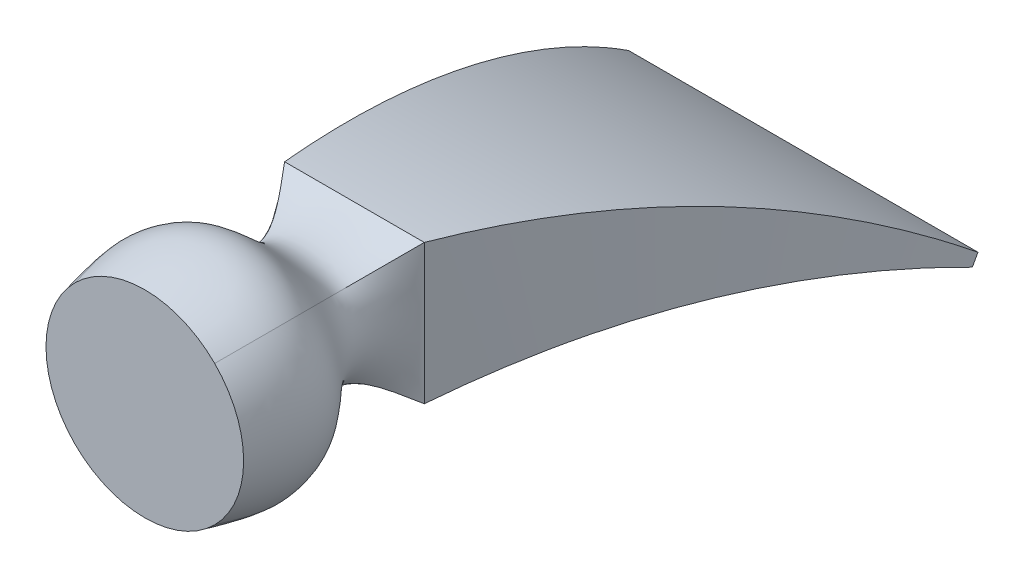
ISO-10303-21;
HEADER;
FILE_DESCRIPTION(('STEP AP214'),'2;1');
FILE_NAME('part.step','',(''),(''),'','','');
FILE_SCHEMA(('AUTOMOTIVE_DESIGN { 1 0 10303 214 1 1 1 1 }'));
ENDSEC;
DATA;
#1=APPLICATION_CONTEXT('core data for automotive mechanical design processes');
#2=APPLICATION_PROTOCOL_DEFINITION('international standard','automotive_design',2000,#1);
#3=PRODUCT_CONTEXT('',#1,'mechanical');
#4=PRODUCT('Part','Part','',(#3));
#5=PRODUCT_RELATED_PRODUCT_CATEGORY('part','',(#4));
#6=PRODUCT_DEFINITION_FORMATION('','',#4);
#7=PRODUCT_DEFINITION_CONTEXT('part definition',#1,'design');
#8=PRODUCT_DEFINITION('design','',#6,#7);
#9=PRODUCT_DEFINITION_SHAPE('','',#8);
#10=(LENGTH_UNIT() NAMED_UNIT(*) SI_UNIT(.MILLI.,.METRE.));
#11=(NAMED_UNIT(*) PLANE_ANGLE_UNIT() SI_UNIT($,.RADIAN.));
#12=(NAMED_UNIT(*) SI_UNIT($,.STERADIAN.) SOLID_ANGLE_UNIT());
#13=UNCERTAINTY_MEASURE_WITH_UNIT(LENGTH_MEASURE(1.E-05),#10,'distance_accuracy_value','');
#14=(GEOMETRIC_REPRESENTATION_CONTEXT(3) GLOBAL_UNCERTAINTY_ASSIGNED_CONTEXT((#13)) GLOBAL_UNIT_ASSIGNED_CONTEXT((#10,
#11,#12)) REPRESENTATION_CONTEXT('',''));
#15=CARTESIAN_POINT('',(0.,0.,0.));
#16=DIRECTION('',(0.,0.,1.));
#17=DIRECTION('',(1.,0.,0.));
#18=AXIS2_PLACEMENT_3D('',#15,#16,#17);
#19=CARTESIAN_POINT('',(0.,0.,90.));
#20=DIRECTION('',(0.,0.,1.));
#21=DIRECTION('',(1.,0.,0.));
#22=AXIS2_PLACEMENT_3D('',#19,#20,#21);
#23=PLANE('',#22);
#24=CARTESIAN_POINT('',(0.,0.,90.));
#25=DIRECTION('',(0.,0.,1.));
#26=DIRECTION('',(1.,0.,0.));
#27=AXIS2_PLACEMENT_3D('',#24,#25,#26);
#28=CIRCLE('',#27,42.4264068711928);
#29=CARTESIAN_POINT('',(30.,-30.,90.));
#30=VERTEX_POINT('',#29);
#31=CARTESIAN_POINT('',(30.,30.,90.));
#32=VERTEX_POINT('',#31);
#33=EDGE_CURVE('E13',#30,#32,#28,.T.);
#34=ORIENTED_EDGE('',*,*,#33,.T.);
#35=CARTESIAN_POINT('',(0.,0.,90.));
#36=DIRECTION('',(0.,0.,1.));
#37=DIRECTION('',(1.,0.,0.));
#38=AXIS2_PLACEMENT_3D('',#35,#36,#37);
#39=CIRCLE('',#38,42.4264068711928);
#40=CARTESIAN_POINT('',(-30.,30.,90.));
#41=VERTEX_POINT('',#40);
#42=EDGE_CURVE('E171',#32,#41,#39,.T.);
#43=ORIENTED_EDGE('',*,*,#42,.T.);
#44=CARTESIAN_POINT('',(0.,0.,90.));
#45=DIRECTION('',(0.,0.,1.));
#46=DIRECTION('',(1.,0.,0.));
#47=AXIS2_PLACEMENT_3D('',#44,#45,#46);
#48=CIRCLE('',#47,42.4264068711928);
#49=CARTESIAN_POINT('',(-30.,-30.,90.));
#50=VERTEX_POINT('',#49);
#51=EDGE_CURVE('E324',#41,#50,#48,.T.);
#52=ORIENTED_EDGE('',*,*,#51,.T.);
#53=CARTESIAN_POINT('',(0.,0.,90.));
#54=DIRECTION('',(0.,0.,1.));
#55=DIRECTION('',(1.,0.,0.));
#56=AXIS2_PLACEMENT_3D('',#53,#54,#55);
#57=CIRCLE('',#56,42.4264068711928);
#58=EDGE_CURVE('E317',#50,#30,#57,.T.);
#59=ORIENTED_EDGE('',*,*,#58,.T.);
#60=EDGE_LOOP('',(#34,#43,#52,#59));
#61=FACE_BOUND('',#60,.T.);
#62=ADVANCED_FACE('F157',(#61),#23,.T.);
#63=CARTESIAN_POINT('',(30.,-30.,90.));
#64=CARTESIAN_POINT('',(32.5042152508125,-32.5042152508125,75.870077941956));
#65=CARTESIAN_POINT('',(36.9162822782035,-36.9162822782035,50.9751879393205));
#66=CARTESIAN_POINT('',(10.49978959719,-10.49978959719,26.5586124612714));
#67=CARTESIAN_POINT('',(23.6871317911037,-23.6871317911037,8.59790826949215));
#68=CARTESIAN_POINT('',(30.,-30.,0.));
#69=CARTESIAN_POINT('',(12.4264068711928,-47.5735931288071,90.));
#70=CARTESIAN_POINT('',(13.3352391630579,-50.6144436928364,74.4669857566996));
#71=CARTESIAN_POINT('',(14.8203809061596,-55.583560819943,49.084164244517));
#72=CARTESIAN_POINT('',(4.36154421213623,-20.5894703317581,30.1541983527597));
#73=CARTESIAN_POINT('',(8.71098951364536,-27.848653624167,6.89356791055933));
#74=CARTESIAN_POINT('',(10.,-30.,0.));
#75=CARTESIAN_POINT('',(-12.4264068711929,-47.5735931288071,90.));
#76=CARTESIAN_POINT('',(-13.3352391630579,-50.6144436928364,74.4669857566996));
#77=CARTESIAN_POINT('',(-14.8203809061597,-55.583560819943,49.084164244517));
#78=CARTESIAN_POINT('',(-4.36154421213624,-20.5894703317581,30.1541983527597));
#79=CARTESIAN_POINT('',(-8.71098951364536,-27.848653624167,6.89356791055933));
#80=CARTESIAN_POINT('',(-9.99999999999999,-30.,0.));
#81=CARTESIAN_POINT('',(-30.,-30.,90.));
#82=CARTESIAN_POINT('',(-32.5042152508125,-32.5042152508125,75.870077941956));
#83=CARTESIAN_POINT('',(-36.9162822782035,-36.9162822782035,50.9751879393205));
#84=CARTESIAN_POINT('',(-10.49978959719,-10.49978959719,26.5586124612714));
#85=CARTESIAN_POINT('',(-23.6871317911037,-23.6871317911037,8.59790826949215));
#86=CARTESIAN_POINT('',(-30.,-30.,0.));
#87=(BOUNDED_SURFACE() B_SPLINE_SURFACE(3,3,((#63,#64,#65,#66,#67,#68),(#69,#70,#71,#72,#73,
#74),(#75,#76,#77,#78,#79,#80),(#81,#82,#83,#84,#85,#86)),.UNSPECIFIED.,.F.,.F.,
.F.) B_SPLINE_SURFACE_WITH_KNOTS((4,4),(4,1,1,4),(0.,1.),(0.,0.406260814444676,
0.715773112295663,1.),
.UNSPECIFIED.) GEOMETRIC_REPRESENTATION_ITEM() RATIONAL_B_SPLINE_SURFACE(((1.,1.,1.,1.,1.,1.),
(0.804737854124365,0.804737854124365,0.843761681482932,0.706169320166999,1.,1.),
(0.804737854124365,0.804737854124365,0.843761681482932,0.706169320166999,1.,1.),(1.,1.,1.,1.,1.,1.))) REPRESENTATION_ITEM('') SURFACE());
#88=CARTESIAN_POINT('',(-30.,-30.,90.));
#89=CARTESIAN_POINT('',(-32.5042152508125,-32.5042152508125,75.870077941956));
#90=CARTESIAN_POINT('',(-36.9162822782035,-36.9162822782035,50.9751879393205));
#91=CARTESIAN_POINT('',(-10.49978959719,-10.49978959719,26.5586124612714));
#92=CARTESIAN_POINT('',(-23.6871317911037,-23.6871317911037,8.59790826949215));
#93=CARTESIAN_POINT('',(-30.,-30.,0.));
#94=B_SPLINE_CURVE_WITH_KNOTS('',3,(#88,#89,#90,#91,#92,#93),.UNSPECIFIED.,.F.,.F.,(4,1,1,4),
(0.,0.406260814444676,0.715773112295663,1.),.UNSPECIFIED.);
#95=CARTESIAN_POINT('',(-30.,-30.,0.));
#96=VERTEX_POINT('',#95);
#97=EDGE_CURVE('E293',#50,#96,#94,.T.);
#98=DIRECTION('',(1.,0.,0.));
#99=VECTOR('',#98,1.);
#100=CARTESIAN_POINT('',(-30.,-30.,0.));
#101=LINE('',#100,#99);
#102=CARTESIAN_POINT('',(30.,-30.,0.));
#103=VERTEX_POINT('',#102);
#104=EDGE_CURVE('E292',#96,#103,#101,.T.);
#105=CARTESIAN_POINT('',(30.,-30.,0.));
#106=CARTESIAN_POINT('',(23.6871317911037,-23.6871317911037,8.59790826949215));
#107=CARTESIAN_POINT('',(10.49978959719,-10.49978959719,26.5586124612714));
#108=CARTESIAN_POINT('',(36.9162822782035,-36.9162822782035,50.9751879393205));
#109=CARTESIAN_POINT('',(32.5042152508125,-32.5042152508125,75.870077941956));
#110=CARTESIAN_POINT('',(30.,-30.,90.));
#111=B_SPLINE_CURVE_WITH_KNOTS('',3,(#105,#106,#107,#108,#109,#110),.UNSPECIFIED.,.F.,.F.,(4,1,
1,4),(0.,0.284226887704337,0.593739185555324,1.),.UNSPECIFIED.);
#112=EDGE_CURVE('E230',#103,#30,#111,.T.);
#113=ORIENTED_EDGE('',*,*,#58,.F.);
#114=ORIENTED_EDGE('',*,*,#97,.T.);
#115=ORIENTED_EDGE('',*,*,#104,.T.);
#116=ORIENTED_EDGE('',*,*,#112,.T.);
#117=EDGE_LOOP('',(#113,#114,#115,#116));
#118=FACE_BOUND('',#117,.T.);
#119=ADVANCED_FACE('F341',(#118),#87,.T.);
#120=CARTESIAN_POINT('',(-30.,-30.,90.));
#121=CARTESIAN_POINT('',(-32.5042152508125,-32.5042152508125,75.870077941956));
#122=CARTESIAN_POINT('',(-36.9162822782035,-36.9162822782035,50.9751879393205));
#123=CARTESIAN_POINT('',(-10.49978959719,-10.49978959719,26.5586124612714));
#124=CARTESIAN_POINT('',(-23.6871317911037,-23.6871317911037,8.59790826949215));
#125=CARTESIAN_POINT('',(-30.,-30.,0.));
#126=CARTESIAN_POINT('',(-47.5735931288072,-12.4264068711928,90.));
#127=CARTESIAN_POINT('',(-50.6144436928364,-13.3352391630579,74.4669857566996));
#128=CARTESIAN_POINT('',(-55.583560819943,-14.8203809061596,49.084164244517));
#129=CARTESIAN_POINT('',(-20.5894703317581,-4.36154421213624,30.1541983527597));
#130=CARTESIAN_POINT('',(-27.848653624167,-8.71098951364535,6.89356791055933));
#131=CARTESIAN_POINT('',(-30.,-9.99999999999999,0.));
#132=CARTESIAN_POINT('',(-47.5735931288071,12.4264068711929,90.));
#133=CARTESIAN_POINT('',(-50.6144436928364,13.3352391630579,74.4669857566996));
#134=CARTESIAN_POINT('',(-55.583560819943,14.8203809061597,49.084164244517));
#135=CARTESIAN_POINT('',(-20.5894703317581,4.36154421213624,30.1541983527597));
#136=CARTESIAN_POINT('',(-27.848653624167,8.71098951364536,6.89356791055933));
#137=CARTESIAN_POINT('',(-30.,10.,0.));
#138=CARTESIAN_POINT('',(-30.,30.,90.));
#139=CARTESIAN_POINT('',(-32.5042152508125,32.5042152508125,75.870077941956));
#140=CARTESIAN_POINT('',(-36.9162822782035,36.9162822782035,50.9751879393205));
#141=CARTESIAN_POINT('',(-10.49978959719,10.49978959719,26.5586124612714));
#142=CARTESIAN_POINT('',(-23.6871317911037,23.6871317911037,8.59790826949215));
#143=CARTESIAN_POINT('',(-30.,30.,0.));
#144=(BOUNDED_SURFACE() B_SPLINE_SURFACE(3,3,((#120,#121,#122,#123,#124,#125),(#126,#127,#128,
#129,#130,#131),(#132,#133,#134,#135,#136,#137),(#138,#139,#140,#141,#142,#143)),.UNSPECIFIED.,
.F.,.F.,.F.) B_SPLINE_SURFACE_WITH_KNOTS((4,4),(4,1,1,4),(0.,1.),(0.,0.406260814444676,
0.715773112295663,1.),
.UNSPECIFIED.) GEOMETRIC_REPRESENTATION_ITEM() RATIONAL_B_SPLINE_SURFACE(((1.,1.,1.,1.,1.,1.),
(0.804737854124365,0.804737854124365,0.843761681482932,0.706169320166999,1.,1.),
(0.804737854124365,0.804737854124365,0.843761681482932,0.706169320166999,1.,1.),(1.,1.,1.,1.,1.,1.))) REPRESENTATION_ITEM('') SURFACE());
#145=CARTESIAN_POINT('',(-30.,30.,90.));
#146=CARTESIAN_POINT('',(-32.5042152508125,32.5042152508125,75.870077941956));
#147=CARTESIAN_POINT('',(-36.9162822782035,36.9162822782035,50.9751879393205));
#148=CARTESIAN_POINT('',(-10.49978959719,10.49978959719,26.5586124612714));
#149=CARTESIAN_POINT('',(-23.6871317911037,23.6871317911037,8.59790826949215));
#150=CARTESIAN_POINT('',(-30.,30.,0.));
#151=B_SPLINE_CURVE_WITH_KNOTS('',3,(#145,#146,#147,#148,#149,#150),.UNSPECIFIED.,.F.,.F.,(4,1,
1,4),(0.,0.406260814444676,0.715773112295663,1.),.UNSPECIFIED.);
#152=CARTESIAN_POINT('',(-30.,30.,0.));
#153=VERTEX_POINT('',#152);
#154=EDGE_CURVE('E291',#41,#153,#151,.T.);
#155=DIRECTION('',(0.,-1.,0.));
#156=VECTOR('',#155,1.);
#157=CARTESIAN_POINT('',(-30.,30.,0.));
#158=LINE('',#157,#156);
#159=EDGE_CURVE('E233',#153,#96,#158,.T.);
#160=ORIENTED_EDGE('',*,*,#51,.F.);
#161=ORIENTED_EDGE('',*,*,#154,.T.);
#162=ORIENTED_EDGE('',*,*,#159,.T.);
#163=ORIENTED_EDGE('',*,*,#97,.F.);
#164=EDGE_LOOP('',(#160,#161,#162,#163));
#165=FACE_BOUND('',#164,.T.);
#166=ADVANCED_FACE('F336',(#165),#144,.T.);
#167=CARTESIAN_POINT('',(30.,30.,90.));
#168=CARTESIAN_POINT('',(32.5042152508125,32.5042152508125,75.870077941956));
#169=CARTESIAN_POINT('',(36.9162822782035,36.9162822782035,50.9751879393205));
#170=CARTESIAN_POINT('',(10.49978959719,10.49978959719,26.5586124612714));
#171=CARTESIAN_POINT('',(23.6871317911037,23.6871317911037,8.59790826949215));
#172=CARTESIAN_POINT('',(30.,30.,0.));
#173=CARTESIAN_POINT('',(47.5735931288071,12.4264068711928,90.));
#174=CARTESIAN_POINT('',(50.6144436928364,13.3352391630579,74.4669857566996));
#175=CARTESIAN_POINT('',(55.583560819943,14.8203809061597,49.084164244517));
#176=CARTESIAN_POINT('',(20.5894703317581,4.36154421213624,30.1541983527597));
#177=CARTESIAN_POINT('',(27.848653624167,8.71098951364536,6.89356791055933));
#178=CARTESIAN_POINT('',(30.,10.,0.));
#179=CARTESIAN_POINT('',(47.5735931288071,-12.4264068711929,90.));
#180=CARTESIAN_POINT('',(50.6144436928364,-13.3352391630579,74.4669857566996));
#181=CARTESIAN_POINT('',(55.583560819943,-14.8203809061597,49.084164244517));
#182=CARTESIAN_POINT('',(20.5894703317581,-4.36154421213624,30.1541983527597));
#183=CARTESIAN_POINT('',(27.848653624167,-8.71098951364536,6.89356791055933));
#184=CARTESIAN_POINT('',(30.,-10.,0.));
#185=CARTESIAN_POINT('',(30.,-30.,90.));
#186=CARTESIAN_POINT('',(32.5042152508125,-32.5042152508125,75.870077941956));
#187=CARTESIAN_POINT('',(36.9162822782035,-36.9162822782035,50.9751879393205));
#188=CARTESIAN_POINT('',(10.49978959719,-10.49978959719,26.5586124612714));
#189=CARTESIAN_POINT('',(23.6871317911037,-23.6871317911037,8.59790826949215));
#190=CARTESIAN_POINT('',(30.,-30.,0.));
#191=(BOUNDED_SURFACE() B_SPLINE_SURFACE(3,3,((#167,#168,#169,#170,#171,#172),(#173,#174,#175,
#176,#177,#178),(#179,#180,#181,#182,#183,#184),(#185,#186,#187,#188,#189,#190)),.UNSPECIFIED.,
.F.,.F.,.F.) B_SPLINE_SURFACE_WITH_KNOTS((4,4),(4,1,1,4),(0.,1.),(0.,0.406260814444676,
0.715773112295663,1.),
.UNSPECIFIED.) GEOMETRIC_REPRESENTATION_ITEM() RATIONAL_B_SPLINE_SURFACE(((1.,1.,1.,1.,1.,1.),
(0.804737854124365,0.804737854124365,0.843761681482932,0.706169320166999,1.,1.),
(0.804737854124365,0.804737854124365,0.843761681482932,0.706169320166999,1.,1.),(1.,1.,1.,1.,1.,1.))) REPRESENTATION_ITEM('') SURFACE());
#192=DIRECTION('',(0.,1.,0.));
#193=VECTOR('',#192,1.);
#194=CARTESIAN_POINT('',(30.,30.,0.));
#195=LINE('',#194,#193);
#196=CARTESIAN_POINT('',(30.,30.,0.));
#197=VERTEX_POINT('',#196);
#198=EDGE_CURVE('E225',#103,#197,#195,.T.);
#199=CARTESIAN_POINT('',(30.,30.,0.));
#200=CARTESIAN_POINT('',(23.6871317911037,23.6871317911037,8.59790826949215));
#201=CARTESIAN_POINT('',(10.49978959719,10.49978959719,26.5586124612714));
#202=CARTESIAN_POINT('',(36.9162822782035,36.9162822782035,50.9751879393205));
#203=CARTESIAN_POINT('',(32.5042152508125,32.5042152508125,75.870077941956));
#204=CARTESIAN_POINT('',(30.,30.,90.));
#205=B_SPLINE_CURVE_WITH_KNOTS('',3,(#199,#200,#201,#202,#203,#204),.UNSPECIFIED.,.F.,.F.,(4,1,
1,4),(0.,0.284226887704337,0.593739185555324,1.),.UNSPECIFIED.);
#206=EDGE_CURVE('E217',#197,#32,#205,.T.);
#207=ORIENTED_EDGE('',*,*,#33,.F.);
#208=ORIENTED_EDGE('',*,*,#112,.F.);
#209=ORIENTED_EDGE('',*,*,#198,.T.);
#210=ORIENTED_EDGE('',*,*,#206,.T.);
#211=EDGE_LOOP('',(#207,#208,#209,#210));
#212=FACE_BOUND('',#211,.T.);
#213=ADVANCED_FACE('F228',(#212),#191,.T.);
#214=CARTESIAN_POINT('',(-30.,30.,90.));
#215=CARTESIAN_POINT('',(-32.5042152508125,32.5042152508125,75.870077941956));
#216=CARTESIAN_POINT('',(-36.9162822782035,36.9162822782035,50.9751879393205));
#217=CARTESIAN_POINT('',(-10.49978959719,10.49978959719,26.5586124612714));
#218=CARTESIAN_POINT('',(-23.6871317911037,23.6871317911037,8.59790826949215));
#219=CARTESIAN_POINT('',(-30.,30.,0.));
#220=CARTESIAN_POINT('',(-12.4264068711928,47.5735931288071,90.));
#221=CARTESIAN_POINT('',(-13.3352391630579,50.6144436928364,74.4669857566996));
#222=CARTESIAN_POINT('',(-14.8203809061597,55.583560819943,49.084164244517));
#223=CARTESIAN_POINT('',(-4.36154421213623,20.5894703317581,30.1541983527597));
#224=CARTESIAN_POINT('',(-8.71098951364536,27.848653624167,6.89356791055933));
#225=CARTESIAN_POINT('',(-10.,30.,0.));
#226=CARTESIAN_POINT('',(12.4264068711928,47.5735931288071,90.));
#227=CARTESIAN_POINT('',(13.3352391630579,50.6144436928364,74.4669857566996));
#228=CARTESIAN_POINT('',(14.8203809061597,55.583560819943,49.084164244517));
#229=CARTESIAN_POINT('',(4.36154421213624,20.5894703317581,30.1541983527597));
#230=CARTESIAN_POINT('',(8.71098951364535,27.848653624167,6.89356791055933));
#231=CARTESIAN_POINT('',(9.99999999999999,30.,0.));
#232=CARTESIAN_POINT('',(30.,30.,90.));
#233=CARTESIAN_POINT('',(32.5042152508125,32.5042152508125,75.870077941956));
#234=CARTESIAN_POINT('',(36.9162822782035,36.9162822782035,50.9751879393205));
#235=CARTESIAN_POINT('',(10.49978959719,10.49978959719,26.5586124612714));
#236=CARTESIAN_POINT('',(23.6871317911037,23.6871317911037,8.59790826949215));
#237=CARTESIAN_POINT('',(30.,30.,0.));
#238=(BOUNDED_SURFACE() B_SPLINE_SURFACE(3,3,((#214,#215,#216,#217,#218,#219),(#220,#221,#222,
#223,#224,#225),(#226,#227,#228,#229,#230,#231),(#232,#233,#234,#235,#236,#237)),.UNSPECIFIED.,
.F.,.F.,.F.) B_SPLINE_SURFACE_WITH_KNOTS((4,4),(4,1,1,4),(0.,1.),(0.,0.406260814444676,
0.715773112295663,1.),
.UNSPECIFIED.) GEOMETRIC_REPRESENTATION_ITEM() RATIONAL_B_SPLINE_SURFACE(((1.,1.,1.,1.,1.,1.),
(0.804737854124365,0.804737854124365,0.843761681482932,0.706169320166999,1.,1.),
(0.804737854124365,0.804737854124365,0.843761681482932,0.706169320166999,1.,1.),(1.,1.,1.,1.,1.,1.))) REPRESENTATION_ITEM('') SURFACE());
#239=DIRECTION('',(-1.,0.,0.));
#240=VECTOR('',#239,1.);
#241=CARTESIAN_POINT('',(-30.,30.,0.));
#242=LINE('',#241,#240);
#243=EDGE_CURVE('E210',#197,#153,#242,.T.);
#244=ORIENTED_EDGE('',*,*,#42,.F.);
#245=ORIENTED_EDGE('',*,*,#206,.F.);
#246=ORIENTED_EDGE('',*,*,#243,.T.);
#247=ORIENTED_EDGE('',*,*,#154,.F.);
#248=EDGE_LOOP('',(#244,#245,#246,#247));
#249=FACE_BOUND('',#248,.T.);
#250=ADVANCED_FACE('F222',(#249),#238,.T.);
#251=CARTESIAN_POINT('',(75.,-51.8749227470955,-190.302098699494));
#252=DIRECTION('',(0.,-0.486182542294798,-0.873857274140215));
#253=DIRECTION('',(-1.,0.,0.));
#254=AXIS2_PLACEMENT_3D('',#251,#252,#253);
#255=PLANE('',#254);
#256=DIRECTION('',(0.,0.87385727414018,-0.48618254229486));
#257=VECTOR('',#256,1.);
#258=CARTESIAN_POINT('',(75.,-49.690279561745,-191.517555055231));
#259=LINE('',#258,#257);
#260=CARTESIAN_POINT('',(75.,-51.8749227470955,-190.302098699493));
#261=VERTEX_POINT('',#260);
#262=CARTESIAN_POINT('',(75.,-47.5056363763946,-192.733011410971));
#263=VERTEX_POINT('',#262);
#264=EDGE_CURVE('E237',#261,#263,#259,.T.);
#265=ORIENTED_EDGE('',*,*,#264,.F.);
#266=DIRECTION('',(1.,0.,0.));
#267=VECTOR('',#266,1.);
#268=CARTESIAN_POINT('',(-4.00374178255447E-12,-51.8749227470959,-190.302098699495));
#269=LINE('',#268,#267);
#270=CARTESIAN_POINT('',(-74.9999999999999,-51.8749227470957,-190.302098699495));
#271=VERTEX_POINT('',#270);
#272=EDGE_CURVE('E253',#271,#261,#269,.T.);
#273=ORIENTED_EDGE('',*,*,#272,.F.);
#274=DIRECTION('',(0.,-0.87385727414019,0.486182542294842));
#275=VECTOR('',#274,1.);
#276=CARTESIAN_POINT('',(-75.,-49.690279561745,-191.517555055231));
#277=LINE('',#276,#275);
#278=CARTESIAN_POINT('',(-74.9999999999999,-47.5056363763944,-192.733011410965));
#279=VERTEX_POINT('',#278);
#280=EDGE_CURVE('E238',#279,#271,#277,.T.);
#281=ORIENTED_EDGE('',*,*,#280,.F.);
#282=DIRECTION('',(-1.,0.,0.));
#283=VECTOR('',#282,1.);
#284=CARTESIAN_POINT('',(-2.94556046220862E-12,-47.5056363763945,-192.733011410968));
#285=LINE('',#284,#283);
#286=EDGE_CURVE('E239',#263,#279,#285,.T.);
#287=ORIENTED_EDGE('',*,*,#286,.F.);
#288=EDGE_LOOP('',(#265,#273,#281,#287));
#289=FACE_BOUND('',#288,.T.);
#290=ADVANCED_FACE('F159',(#289),#255,.T.);
#291=CARTESIAN_POINT('',(-75.9,-30.,0.));
#292=CARTESIAN_POINT('',(-25.2999999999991,-30.,0.));
#293=CARTESIAN_POINT('',(25.299999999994,-29.9999999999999,0.));
#294=CARTESIAN_POINT('',(75.9000000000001,-30.,0.));
#295=CARTESIAN_POINT('',(-75.9000000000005,-25.8587039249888,-27.8247429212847));
#296=CARTESIAN_POINT('',(-25.299999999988,-25.8587039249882,-27.8247429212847));
#297=CARTESIAN_POINT('',(25.2999999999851,-25.8587039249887,-27.8247429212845));
#298=CARTESIAN_POINT('',(75.9000000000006,-25.8587039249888,-27.8247429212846));
#299=CARTESIAN_POINT('',(-75.8999999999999,-24.4043835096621,-75.5040965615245));
#300=CARTESIAN_POINT('',(-25.2999999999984,-24.404383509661,-75.5040965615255));
#301=CARTESIAN_POINT('',(25.2999999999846,-24.4043835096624,-75.5040965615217));
#302=CARTESIAN_POINT('',(75.9000000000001,-24.404383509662,-75.5040965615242));
#303=CARTESIAN_POINT('',(-75.9,-34.7352218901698,-139.435443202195));
#304=CARTESIAN_POINT('',(-25.3000000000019,-34.7352218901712,-139.435443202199));
#305=CARTESIAN_POINT('',(25.2999999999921,-34.7352218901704,-139.4354432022));
#306=CARTESIAN_POINT('',(75.9000000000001,-34.7352218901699,-139.435443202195));
#307=CARTESIAN_POINT('',(-75.8999999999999,-45.6587187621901,-174.28533023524));
#308=CARTESIAN_POINT('',(-25.2999999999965,-45.6587187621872,-174.285330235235));
#309=CARTESIAN_POINT('',(25.2999999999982,-45.6587187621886,-174.285330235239));
#310=CARTESIAN_POINT('',(75.9,-45.6587187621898,-174.28533023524));
#311=CARTESIAN_POINT('',(-75.9,-51.8749227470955,-190.302098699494));
#312=CARTESIAN_POINT('',(-25.2999999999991,-51.8749227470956,-190.302098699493));
#313=CARTESIAN_POINT('',(25.299999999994,-51.8749227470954,-190.302098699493));
#314=CARTESIAN_POINT('',(75.9000000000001,-51.8749227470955,-190.302098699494));
#315=B_SPLINE_SURFACE_WITH_KNOTS('',3,3,((#291,#292,#293,#294),(#295,#296,#297,#298),(#299,#300,
#301,#302),(#303,#304,#305,#306),(#307,#308,#309,#310),(#311,#312,#313,#314)),.UNSPECIFIED.,.F.,
.F.,.F.,(4,1,1,4),(4,4),(0.,0.435669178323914,0.733921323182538,1.),(0.,1.),.UNSPECIFIED.);
#316=CARTESIAN_POINT('',(-30.,-30.,0.));
#317=CARTESIAN_POINT('',(-30.798412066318,-29.5120778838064,-3.27825663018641));
#318=CARTESIAN_POINT('',(-31.5953504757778,-29.0695945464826,-6.5636176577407));
#319=CARTESIAN_POINT('',(-33.1862582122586,-28.2752958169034,-13.1458186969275));
#320=CARTESIAN_POINT('',(-33.9802276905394,-27.9234757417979,-16.4426581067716));
#321=CARTESIAN_POINT('',(-35.5652442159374,-27.310249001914,-23.0453667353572));
#322=CARTESIAN_POINT('',(-36.3562913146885,-27.0488407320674,-26.3512357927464));
#323=CARTESIAN_POINT('',(-37.9353203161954,-26.6162285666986,-32.9687858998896));
#324=CARTESIAN_POINT('',(-38.7233028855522,-26.4450038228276,-36.2804654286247));
#325=CARTESIAN_POINT('',(-40.2964301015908,-26.1924079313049,-42.9079815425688));
#326=CARTESIAN_POINT('',(-41.0815746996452,-26.1110383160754,-46.2238181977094));
#327=CARTESIAN_POINT('',(-42.6490580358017,-26.037894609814,-52.8572039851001));
#328=CARTESIAN_POINT('',(-43.4313967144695,-26.0461224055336,-56.1747531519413));
#329=CARTESIAN_POINT('',(-45.0742822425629,-26.1574082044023,-63.1531175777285));
#330=CARTESIAN_POINT('',(-45.9345259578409,-26.2702119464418,-66.8138524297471));
#331=CARTESIAN_POINT('',(-47.6516731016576,-26.6042975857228,-74.1311967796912));
#332=CARTESIAN_POINT('',(-48.5085764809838,-26.8255810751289,-77.7878062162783));
#333=CARTESIAN_POINT('',(-50.2190815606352,-27.3763479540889,-85.093651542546));
#334=CARTESIAN_POINT('',(-51.0726832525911,-27.7058316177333,-88.7428874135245));
#335=CARTESIAN_POINT('',(-52.7767986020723,-28.4723107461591,-96.031629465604));
#336=CARTESIAN_POINT('',(-53.6273115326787,-28.9093300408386,-99.6711333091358));
#337=CARTESIAN_POINT('',(-55.3250878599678,-29.8899083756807,-106.936510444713));
#338=CARTESIAN_POINT('',(-56.1723512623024,-30.4334672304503,-110.562383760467));
#339=CARTESIAN_POINT('',(-57.8636656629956,-31.6262322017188,-117.797461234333));
#340=CARTESIAN_POINT('',(-58.707716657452,-32.275438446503,-121.406665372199));
#341=CARTESIAN_POINT('',(-60.4184739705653,-33.7000965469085,-128.715756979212));
#342=CARTESIAN_POINT('',(-61.2850815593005,-34.4788085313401,-132.415032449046));
#343=CARTESIAN_POINT('',(-63.0149752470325,-36.1465620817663,-139.789437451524));
#344=CARTESIAN_POINT('',(-63.8782613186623,-37.0356045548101,-143.464566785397));
#345=CARTESIAN_POINT('',(-65.6015514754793,-38.9228370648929,-150.787514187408));
#346=CARTESIAN_POINT('',(-66.4615555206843,-39.9210284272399,-154.435331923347));
#347=CARTESIAN_POINT('',(-68.1781192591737,-42.0249193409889,-161.699757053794));
#348=CARTESIAN_POINT('',(-69.0346796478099,-43.1305959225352,-165.316370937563));
#349=CARTESIAN_POINT('',(-70.7445686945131,-45.4482740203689,-172.516091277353));
#350=CARTESIAN_POINT('',(-71.5978973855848,-46.6602744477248,-176.099198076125));
#351=CARTESIAN_POINT('',(-73.3013417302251,-49.189220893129,-183.228815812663));
#352=CARTESIAN_POINT('',(-74.1514574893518,-50.5061634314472,-186.775327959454));
#353=CARTESIAN_POINT('',(-74.9999999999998,-51.8749227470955,-190.302098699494));
#354=B_SPLINE_CURVE_WITH_KNOTS('',3,(#316,#317,#318,#319,#320,#321,#322,#323,#324,#325,#326,
#327,#328,#329,#330,#331,#332,#333,#334,#335,#336,#337,#338,#339,#340,#341,#342,#343,#344,#345,
#346,#347,#348,#349,#350,#351,#352,#353),.UNSPECIFIED.,.F.,.F.,(4,2,2,2,2,2,2,2,2,2,2,2,2,2,2,2,
2,2,4),(0.,10.2271999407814,20.4538715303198,30.6803615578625,40.904486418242,51.128785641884,
61.3533001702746,72.6381325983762,83.9231306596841,95.2081573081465,106.495686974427,
117.783196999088,129.070720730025,140.704282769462,152.337940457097,163.971739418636,
175.603057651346,187.234256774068,198.865070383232),.UNSPECIFIED.);
#355=EDGE_CURVE('E218',#96,#271,#354,.T.);
#356=CARTESIAN_POINT('',(30.,-29.9999999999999,0.));
#357=CARTESIAN_POINT('',(30.7984113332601,-29.5120778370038,-3.27825673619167));
#358=CARTESIAN_POINT('',(31.5953455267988,-29.0695943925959,-6.56361870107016));
#359=CARTESIAN_POINT('',(33.1862440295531,-28.2752954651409,-13.1458218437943));
#360=CARTESIAN_POINT('',(33.9802084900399,-27.9234753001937,-16.4426624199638));
#361=CARTESIAN_POINT('',(35.5652203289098,-27.310248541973,-23.0453721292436));
#362=CARTESIAN_POINT('',(36.3562677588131,-27.0488403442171,-26.3512411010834));
#363=CARTESIAN_POINT('',(37.9353039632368,-26.6162283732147,-32.9687894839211));
#364=CARTESIAN_POINT('',(38.7232934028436,-26.4450037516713,-36.2804673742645));
#365=CARTESIAN_POINT('',(40.296438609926,-26.1924080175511,-42.9079792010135));
#366=CARTESIAN_POINT('',(41.0815943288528,-26.111038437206,-46.223813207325));
#367=CARTESIAN_POINT('',(42.6490981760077,-26.0378946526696,-52.8571941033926));
#368=CARTESIAN_POINT('',(43.4314462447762,-26.0461223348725,-56.1747410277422));
#369=CARTESIAN_POINT('',(45.0743458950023,-26.1574078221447,-63.1531020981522));
#370=CARTESIAN_POINT('',(45.9345937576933,-26.2702113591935,-66.8138359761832));
#371=CARTESIAN_POINT('',(47.6517425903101,-26.6042966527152,-74.1311799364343));
#372=CARTESIAN_POINT('',(48.5086435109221,-26.8255800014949,-77.7877899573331));
#373=CARTESIAN_POINT('',(50.2191419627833,-27.3763466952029,-85.0936368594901));
#374=CARTESIAN_POINT('',(51.0727394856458,-27.7058303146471,-88.7428737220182));
#375=CARTESIAN_POINT('',(52.7768526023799,-28.4723092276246,-96.0316163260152));
#376=CARTESIAN_POINT('',(53.6273674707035,-28.9093283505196,-99.6711197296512));
#377=CARTESIAN_POINT('',(55.325149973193,-29.8899062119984,-106.936495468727));
#378=CARTESIAN_POINT('',(56.172417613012,-30.4334647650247,-110.562367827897));
#379=CARTESIAN_POINT('',(57.8637354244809,-31.6262292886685,-117.797444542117));
#380=CARTESIAN_POINT('',(58.7077855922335,-32.2754353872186,-121.406648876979));
#381=CARTESIAN_POINT('',(60.4185343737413,-33.7000935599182,-128.715742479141));
#382=CARTESIAN_POINT('',(61.2851340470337,-34.4788057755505,-132.415019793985));
#383=CARTESIAN_POINT('',(63.0150072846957,-36.1465601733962,-139.789429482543));
#384=CARTESIAN_POINT('',(63.8782808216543,-37.035603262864,-143.464561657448));
#385=CARTESIAN_POINT('',(65.6015491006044,-38.9228369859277,-150.787513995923));
#386=CARTESIAN_POINT('',(66.4615438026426,-39.9210289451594,-154.435333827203));
#387=CARTESIAN_POINT('',(68.1780965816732,-42.0249206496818,-161.699761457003));
#388=CARTESIAN_POINT('',(69.0346553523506,-43.1305974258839,-165.316375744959));
#389=CARTESIAN_POINT('',(70.7445479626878,-45.4482754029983,-172.516095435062));
#390=CARTESIAN_POINT('',(71.5978818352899,-46.6602755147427,-176.099201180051));
#391=CARTESIAN_POINT('',(73.3013360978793,-49.1892213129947,-183.228816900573));
#392=CARTESIAN_POINT('',(74.1514565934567,-50.5061635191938,-186.775328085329));
#393=CARTESIAN_POINT('',(75.,-51.8749227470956,-190.302098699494));
#394=B_SPLINE_CURVE_WITH_KNOTS('',3,(#356,#357,#358,#359,#360,#361,#362,#363,#364,#365,#366,
#367,#368,#369,#370,#371,#372,#373,#374,#375,#376,#377,#378,#379,#380,#381,#382,#383,#384,#385,
#386,#387,#388,#389,#390,#391,#392,#393),.UNSPECIFIED.,.F.,.F.,(4,2,2,2,2,2,2,2,2,2,2,2,2,2,2,2,
2,2,4),(0.,10.2271997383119,20.4538712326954,30.6803612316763,40.9044860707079,51.1287852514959,
61.3532996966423,72.6381321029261,83.9231301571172,95.2081568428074,106.4956864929,
117.783196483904,129.07072014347,140.704282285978,152.337940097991,163.971739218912,
175.603057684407,187.23425701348,198.865070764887),.UNSPECIFIED.);
#395=EDGE_CURVE('E254',#103,#261,#394,.T.);
#396=ORIENTED_EDGE('',*,*,#355,.T.);
#397=ORIENTED_EDGE('',*,*,#272,.T.);
#398=ORIENTED_EDGE('',*,*,#395,.F.);
#399=ORIENTED_EDGE('',*,*,#104,.F.);
#400=EDGE_LOOP('',(#396,#397,#398,#399));
#401=FACE_BOUND('',#400,.T.);
#402=ADVANCED_FACE('F258',(#401),#315,.T.);
#403=CARTESIAN_POINT('',(30.,-30.36,0.));
#404=CARTESIAN_POINT('',(29.9999999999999,-10.1199999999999,0.));
#405=CARTESIAN_POINT('',(30.,10.1200000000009,0.));
#406=CARTESIAN_POINT('',(30.,30.36,0.));
#407=CARTESIAN_POINT('',(33.74996194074,-30.3600390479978,-15.3819893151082));
#408=CARTESIAN_POINT('',(33.7499616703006,-10.1200412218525,-16.2383270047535));
#409=CARTESIAN_POINT('',(33.7499614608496,10.1199566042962,-17.0946647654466));
#410=CARTESIAN_POINT('',(33.7499612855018,30.3599544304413,-17.9510025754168));
#411=CARTESIAN_POINT('',(41.7857098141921,-32.4554422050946,-48.3436845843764));
#412=CARTESIAN_POINT('',(41.785709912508,-12.3320986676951,-51.0350516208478));
#413=CARTESIAN_POINT('',(41.7857099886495,7.79124486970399,-53.726418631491));
#414=CARTESIAN_POINT('',(41.785710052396,27.9145884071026,-56.4177856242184));
#415=CARTESIAN_POINT('',(56.785722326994,-44.6785924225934,-108.81112064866));
#416=CARTESIAN_POINT('',(56.7857222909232,-25.2357302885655,-114.868801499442));
#417=CARTESIAN_POINT('',(56.7857222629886,-5.79286815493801,-120.926482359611));
#418=CARTESIAN_POINT('',(56.7857222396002,13.6499939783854,-126.984163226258));
#419=CARTESIAN_POINT('',(68.0357939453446,-62.3319822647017,-151.794031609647));
#420=CARTESIAN_POINT('',(68.0357944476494,-43.8719122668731,-160.244638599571));
#421=CARTESIAN_POINT('',(68.0357948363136,-25.411842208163,-168.695245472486));
#422=CARTESIAN_POINT('',(68.0357951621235,-6.95177210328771,-177.145852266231));
#423=CARTESIAN_POINT('',(75.,-76.2205864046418,-176.757053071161));
#424=CARTESIAN_POINT('',(74.9999999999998,-58.533715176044,-186.597387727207));
#425=CARTESIAN_POINT('',(75.0000000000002,-40.8468439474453,-196.437722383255));
#426=CARTESIAN_POINT('',(75.,-23.1599727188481,-206.278057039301));
#427=B_SPLINE_SURFACE_WITH_KNOTS('',3,3,((#403,#404,#405,#406),(#407,#408,#409,#410),(#411,#412,
#413,#414),(#415,#416,#417,#418),(#419,#420,#421,#422),(#423,#424,#425,#426)),.UNSPECIFIED.,.F.,
.F.,.F.,(4,1,1,4),(4,4),(0.,0.250000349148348,0.53571423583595,1.),(0.,1.),.UNSPECIFIED.);
#428=CARTESIAN_POINT('',(30.,29.9999999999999,0.));
#429=CARTESIAN_POINT('',(30.6915285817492,29.5773995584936,-3.30752513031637));
#430=CARTESIAN_POINT('',(31.3840312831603,29.1154205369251,-6.60981834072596));
#431=CARTESIAN_POINT('',(32.7710104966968,28.1128599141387,-13.2020718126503));
#432=CARTESIAN_POINT('',(33.4654870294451,27.5722774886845,-16.4920319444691));
#433=CARTESIAN_POINT('',(34.856426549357,26.4126721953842,-23.0576881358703));
#434=CARTESIAN_POINT('',(35.5528895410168,25.7936491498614,-26.3333841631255));
#435=CARTESIAN_POINT('',(36.9477893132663,24.4773498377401,-32.8684490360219));
#436=CARTESIAN_POINT('',(37.6462260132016,23.7800767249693,-36.1278185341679));
#437=CARTESIAN_POINT('',(39.045119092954,22.3074251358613,-42.6284340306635));
#438=CARTESIAN_POINT('',(39.7455754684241,21.5320468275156,-45.8696800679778));
#439=CARTESIAN_POINT('',(41.1485164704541,19.9033416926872,-52.3320630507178));
#440=CARTESIAN_POINT('',(41.8510011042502,19.0500145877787,-55.5531999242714));
#441=CARTESIAN_POINT('',(43.6098861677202,16.8194590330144,-63.5790061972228));
#442=CARTESIAN_POINT('',(44.6675856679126,15.3936472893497,-68.3699806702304));
#443=CARTESIAN_POINT('',(46.787636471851,12.3687138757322,-77.8957036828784));
#444=CARTESIAN_POINT('',(47.8499877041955,10.7695948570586,-82.6304530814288));
#445=CARTESIAN_POINT('',(49.9795215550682,7.39930167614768,-92.0376593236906));
#446=CARTESIAN_POINT('',(51.0467045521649,5.62811380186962,-96.7101111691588));
#447=CARTESIAN_POINT('',(53.1858996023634,1.91518704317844,-105.985763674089));
#448=CARTESIAN_POINT('',(54.2579116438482,-0.0265514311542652,-110.58896450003));
#449=CARTESIAN_POINT('',(55.8706458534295,-3.06786719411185,-117.441275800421));
#450=CARTESIAN_POINT('',(56.4095877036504,-4.10426561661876,-119.719034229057));
#451=CARTESIAN_POINT('',(57.4886735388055,-6.21905392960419,-124.254549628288));
#452=CARTESIAN_POINT('',(58.0288174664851,-7.29744185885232,-126.512307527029));
#453=CARTESIAN_POINT('',(59.6512466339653,-10.5954587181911,-133.255123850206));
#454=CARTESIAN_POINT('',(60.735425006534,-12.8777439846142,-137.709281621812));
#455=CARTESIAN_POINT('',(62.9088342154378,-17.6065380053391,-146.528431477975));
#456=CARTESIAN_POINT('',(63.9980652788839,-20.0530542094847,-150.893419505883));
#457=CARTESIAN_POINT('',(66.1832491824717,-25.1112743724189,-159.533990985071));
#458=CARTESIAN_POINT('',(67.279209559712,-27.7232163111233,-163.809433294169));
#459=CARTESIAN_POINT('',(69.4762739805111,-33.106114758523,-172.257417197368));
#460=CARTESIAN_POINT('',(70.5773778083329,-35.8770646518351,-176.429963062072));
#461=CARTESIAN_POINT('',(72.7847728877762,-41.575018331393,-184.665378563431));
#462=CARTESIAN_POINT('',(73.8910638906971,-44.5020147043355,-188.728253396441));
#463=CARTESIAN_POINT('',(75.,-47.5056363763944,-192.733011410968));
#464=B_SPLINE_CURVE_WITH_KNOTS('',3,(#428,#429,#430,#431,#432,#433,#434,#435,#436,#437,#438,
#439,#440,#441,#442,#443,#444,#445,#446,#447,#448,#449,#450,#451,#452,#453,#454,#455,#456,#457,
#458,#459,#460,#461,#462,#463),.UNSPECIFIED.,.F.,.F.,(4,2,2,2,2,2,2,2,2,2,2,2,2,2,2,2,2,4),(0.,
10.2158740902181,20.4318553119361,30.64785967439,40.8634524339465,51.0790232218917,
61.2946305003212,76.6191451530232,91.9434254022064,107.268927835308,122.59439342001,
130.273536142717,137.952320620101,153.311376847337,168.671130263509,184.053505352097,
199.435240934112,214.816246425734),.UNSPECIFIED.);
#465=EDGE_CURVE('E161',#197,#263,#464,.T.);
#466=ORIENTED_EDGE('',*,*,#395,.T.);
#467=ORIENTED_EDGE('',*,*,#264,.T.);
#468=ORIENTED_EDGE('',*,*,#465,.F.);
#469=ORIENTED_EDGE('',*,*,#198,.F.);
#470=EDGE_LOOP('',(#466,#467,#468,#469));
#471=FACE_BOUND('',#470,.T.);
#472=ADVANCED_FACE('F235',(#471),#427,.T.);
#473=CARTESIAN_POINT('',(-75.,-76.2205864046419,-176.757053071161));
#474=CARTESIAN_POINT('',(-74.9999999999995,-58.5337151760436,-186.597387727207));
#475=CARTESIAN_POINT('',(-75.0000000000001,-40.8468439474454,-196.437722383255));
#476=CARTESIAN_POINT('',(-75.,-23.1599727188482,-206.278057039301));
#477=CARTESIAN_POINT('',(-71.2500380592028,-68.7421658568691,-163.315370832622));
#478=CARTESIAN_POINT('',(-71.2500383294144,-50.6389600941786,-172.407387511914));
#479=CARTESIAN_POINT('',(-71.2500385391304,-32.5357542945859,-181.499404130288));
#480=CARTESIAN_POINT('',(-71.250038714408,-14.432548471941,-190.591420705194));
#481=CARTESIAN_POINT('',(-63.2142901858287,-54.5478483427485,-133.492805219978));
#482=CARTESIAN_POINT('',(-63.2142900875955,-35.6544225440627,-140.924552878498));
#483=CARTESIAN_POINT('',(-63.2142900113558,-16.7609967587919,-148.356300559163));
#484=CARTESIAN_POINT('',(-63.2142899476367,2.13242901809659,-155.788048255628));
#485=CARTESIAN_POINT('',(-48.2142776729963,-35.8309252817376,-74.7102141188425));
#486=CARTESIAN_POINT('',(-48.2142777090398,-15.8955000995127,-78.8694457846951));
#487=CARTESIAN_POINT('',(-48.2142777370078,4.0399250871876,-83.0286774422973));
#488=CARTESIAN_POINT('',(-48.2142777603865,23.9753502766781,-87.1879090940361));
#489=CARTESIAN_POINT('',(-36.964206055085,-30.3599274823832,-28.5665147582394));
#490=CARTESIAN_POINT('',(-36.9642055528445,-10.1199234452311,-30.1568541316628));
#491=CARTESIAN_POINT('',(-36.9642051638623,10.12008059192,-31.7471936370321));
#492=CARTESIAN_POINT('',(-36.9642048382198,30.3600846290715,-33.3375332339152));
#493=CARTESIAN_POINT('',(-30.,-30.36,0.));
#494=CARTESIAN_POINT('',(-29.9999999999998,-10.1199999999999,0.));
#495=CARTESIAN_POINT('',(-30.,10.1200000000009,0.));
#496=CARTESIAN_POINT('',(-30.,30.36,0.));
#497=B_SPLINE_SURFACE_WITH_KNOTS('',3,3,((#473,#474,#475,#476),(#477,#478,#479,#480),(#481,#482,
#483,#484),(#485,#486,#487,#488),(#489,#490,#491,#492),(#493,#494,#495,#496)),.UNSPECIFIED.,.F.,
.F.,.F.,(4,1,1,4),(4,4),(0.,0.250000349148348,0.53571423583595,1.),(0.,1.),.UNSPECIFIED.);
#498=CARTESIAN_POINT('',(-30.,29.9999999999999,0.));
#499=CARTESIAN_POINT('',(-30.6915289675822,29.5773995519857,-3.30752504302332));
#500=CARTESIAN_POINT('',(-31.3840350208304,29.1154206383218,-6.60981755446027));
#501=CARTESIAN_POINT('',(-32.7710222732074,28.1128603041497,-13.2020693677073));
#502=CARTESIAN_POINT('',(-33.465503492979,27.5722780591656,-16.4920285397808));
#503=CARTESIAN_POINT('',(-34.8564491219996,26.4126730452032,-23.057683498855));
#504=CARTESIAN_POINT('',(-35.5529135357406,25.7936500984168,-26.3333792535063));
#505=CARTESIAN_POINT('',(-36.9478111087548,24.4773507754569,-32.8684445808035));
#506=CARTESIAN_POINT('',(-37.6462441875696,23.7800775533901,-36.1278148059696));
#507=CARTESIAN_POINT('',(-39.0451253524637,22.3074254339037,-42.6284327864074));
#508=CARTESIAN_POINT('',(-39.7455734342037,21.5320467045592,-45.869680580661));
#509=CARTESIAN_POINT('',(-41.1484960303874,19.9033406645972,-52.3320671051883));
#510=CARTESIAN_POINT('',(-41.8509705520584,19.0500130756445,-55.5532057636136));
#511=CARTESIAN_POINT('',(-43.6098340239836,16.819455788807,-63.5790172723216));
#512=CARTESIAN_POINT('',(-44.6675238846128,15.3936425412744,-68.3699955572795));
#513=CARTESIAN_POINT('',(-46.7875648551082,12.3687100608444,-77.8957157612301));
#514=CARTESIAN_POINT('',(-47.8499158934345,10.7695934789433,-82.6304585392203));
#515=CARTESIAN_POINT('',(-49.9794252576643,7.39935032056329,-92.0375219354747));
#516=CARTESIAN_POINT('',(-51.0465838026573,5.62821582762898,-96.7098396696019));
#517=CARTESIAN_POINT('',(-53.185765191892,1.91532646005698,-105.985431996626));
#518=CARTESIAN_POINT('',(-54.2577883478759,-0.0264395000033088,-110.588702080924));
#519=CARTESIAN_POINT('',(-56.4088822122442,-4.08300906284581,-119.728476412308));
#520=CARTESIAN_POINT('',(-57.4879628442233,-6.19815807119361,-124.264825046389));
#521=CARTESIAN_POINT('',(-59.6512084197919,-10.5955272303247,-133.255253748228));
#522=CARTESIAN_POINT('',(-60.7353739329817,-12.8777665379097,-137.709324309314));
#523=CARTESIAN_POINT('',(-62.9087923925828,-17.6065250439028,-146.528406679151));
#524=CARTESIAN_POINT('',(-63.9980455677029,-20.0530516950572,-150.893414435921));
#525=CARTESIAN_POINT('',(-66.1832602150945,-25.1112779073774,-159.533997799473));
#526=CARTESIAN_POINT('',(-67.2792292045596,-27.7232154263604,-163.809432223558));
#527=CARTESIAN_POINT('',(-69.4762983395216,-33.106110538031,-172.257410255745));
#528=CARTESIAN_POINT('',(-70.5773982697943,-35.8770615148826,-176.429958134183));
#529=CARTESIAN_POINT('',(-72.784782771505,-41.5750177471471,-184.665378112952));
#530=CARTESIAN_POINT('',(-73.8910670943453,-44.5020155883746,-188.72825541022));
#531=CARTESIAN_POINT('',(-74.9999999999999,-47.5056363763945,-192.733011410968));
#532=B_SPLINE_CURVE_WITH_KNOTS('',3,(#498,#499,#500,#501,#502,#503,#504,#505,#506,#507,#508,
#509,#510,#511,#512,#513,#514,#515,#516,#517,#518,#519,#520,#521,#522,#523,#524,#525,#526,#527,
#528,#529,#530,#531),.UNSPECIFIED.,.F.,.F.,(4,2,2,2,2,2,2,2,2,2,2,2,2,2,2,2,4),(0.,
10.2158740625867,20.4318552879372,30.6478596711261,40.863452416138,51.0790231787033,
61.2946304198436,76.6191451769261,91.9434255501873,107.26841149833,122.594393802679,
137.951686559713,153.310742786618,168.670496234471,184.052871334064,199.434606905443,
214.815612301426),.UNSPECIFIED.);
#533=EDGE_CURVE('E215',#153,#279,#532,.T.);
#534=ORIENTED_EDGE('',*,*,#533,.T.);
#535=ORIENTED_EDGE('',*,*,#280,.T.);
#536=ORIENTED_EDGE('',*,*,#355,.F.);
#537=ORIENTED_EDGE('',*,*,#159,.F.);
#538=EDGE_LOOP('',(#534,#535,#536,#537));
#539=FACE_BOUND('',#538,.T.);
#540=ADVANCED_FACE('F263',(#539),#497,.T.);
#541=CARTESIAN_POINT('',(-75.9000000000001,-47.5056363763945,-192.733011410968));
#542=CARTESIAN_POINT('',(-25.3000000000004,-47.5056363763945,-192.733011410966));
#543=CARTESIAN_POINT('',(25.2999999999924,-47.5056363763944,-192.733011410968));
#544=CARTESIAN_POINT('',(75.9,-47.5056363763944,-192.733011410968));
#545=CARTESIAN_POINT('',(-75.9000000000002,-29.1742359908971,-168.291498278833));
#546=CARTESIAN_POINT('',(-25.2999999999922,-29.1742359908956,-168.291498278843));
#547=CARTESIAN_POINT('',(25.2999999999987,-29.1742359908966,-168.291498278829));
#548=CARTESIAN_POINT('',(75.9000000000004,-29.1742359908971,-168.291498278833));
#549=CARTESIAN_POINT('',(-75.9,-3.15103616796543,-123.547021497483));
#550=CARTESIAN_POINT('',(-25.3000000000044,-3.15103616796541,-123.54702149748));
#551=CARTESIAN_POINT('',(25.2999999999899,-3.15103616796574,-123.547021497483));
#552=CARTESIAN_POINT('',(75.9,-3.15103616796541,-123.547021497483));
#553=CARTESIAN_POINT('',(-75.9000000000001,20.0402907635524,-57.2626207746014));
#554=CARTESIAN_POINT('',(-25.3000000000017,20.040290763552,-57.2626207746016));
#555=CARTESIAN_POINT('',(25.2999999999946,20.0402907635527,-57.2626207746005));
#556=CARTESIAN_POINT('',(75.9000000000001,20.0402907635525,-57.2626207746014));
#557=CARTESIAN_POINT('',(-75.9,27.6434075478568,-18.4441250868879));
#558=CARTESIAN_POINT('',(-25.2999999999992,27.643407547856,-18.4441250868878));
#559=CARTESIAN_POINT('',(25.2999999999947,27.6434075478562,-18.4441250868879));
#560=CARTESIAN_POINT('',(75.8999999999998,27.6434075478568,-18.4441250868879));
#561=CARTESIAN_POINT('',(-75.9000000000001,30.,0.));
#562=CARTESIAN_POINT('',(-25.3000000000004,29.9999999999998,0.));
#563=CARTESIAN_POINT('',(25.2999999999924,29.9999999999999,0.));
#564=CARTESIAN_POINT('',(75.9,30.,0.));
#565=B_SPLINE_SURFACE_WITH_KNOTS('',3,3,((#541,#542,#543,#544),(#545,#546,#547,#548),(#549,#550,
#551,#552),(#553,#554,#555,#556),(#557,#558,#559,#560),(#561,#562,#563,#564)),.UNSPECIFIED.,.F.,
.F.,.F.,(4,1,1,4),(4,4),(0.,0.436339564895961,0.734442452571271,1.),(0.,1.),.UNSPECIFIED.);
#566=ORIENTED_EDGE('',*,*,#465,.T.);
#567=ORIENTED_EDGE('',*,*,#286,.T.);
#568=ORIENTED_EDGE('',*,*,#533,.F.);
#569=ORIENTED_EDGE('',*,*,#243,.F.);
#570=EDGE_LOOP('',(#566,#567,#568,#569));
#571=FACE_BOUND('',#570,.T.);
#572=ADVANCED_FACE('F211',(#571),#565,.T.);
#573=CLOSED_SHELL('',(#62,#119,#166,#213,#250,#290,#402,#472,#540,#572));
#574=MANIFOLD_SOLID_BREP('B2',#573);
#575=ADVANCED_BREP_SHAPE_REPRESENTATION('',(#18,#574),#14);
#576=SHAPE_DEFINITION_REPRESENTATION(#9,#575);
ENDSEC;
END-ISO-10303-21;
